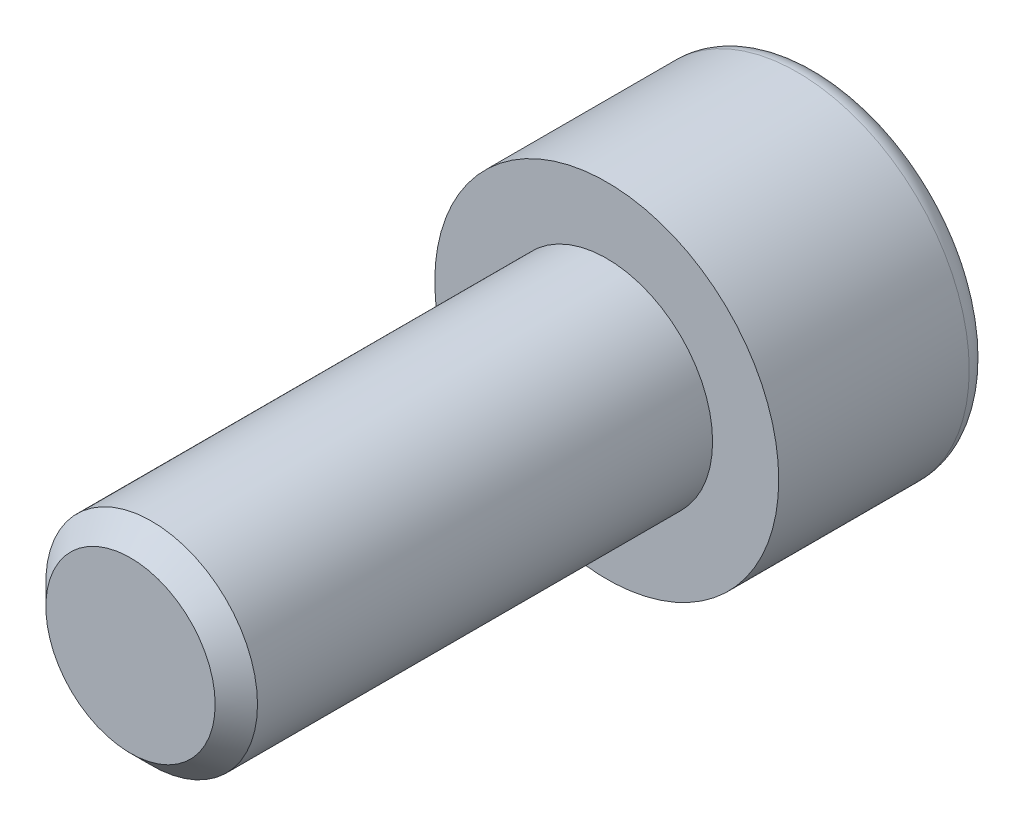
from build123d import *

# Parameters (mm, degrees)
ENLEV_MAT_EXTRU1_DEPTH = 4
ESQUISSE3_W            = 4
ESQUISSE3_H            = 18
CHANFREIN1_SIZE        = 0.8


with BuildPart() as part:
    # Esquisse1 → Base-R_volution (revolve)
    with BuildSketch(Plane(origin=(0, 0, 0), x_dir=(1, 0, 0), z_dir=(0, 1, 0)), mode=Mode.PRIVATE) as base_r_volution_sk:
        with BuildLine():
            Line((0, 0), (6.5, 0))
            Line((6.5, 0), (6.5, 7.2))
            ThreePointArc((6.5, 7.2), (6.265685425, 7.765685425), (5.7, 8))
            Line((5.7, 8), (0, 8))
            Line((0, 8), (0, 0))
        make_face()
    revolve(base_r_volution_sk.sketch.rotate(Axis((0, 0, 0), (0, 0, -1)), 180), axis=Axis((0, 0, 0), (0, 0, -1)))

    # Esquisse2 → enlev-mat-Extru1 (cut)
    with BuildSketch(Plane.XY.offset(-8)):
        Polygon((3, -1.732050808), (3, 1.732050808), (0, 3.464101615), (-3, 1.732050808), (-3, -1.732050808), (0, -3.464101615), align=None)
    extrude(amount=ENLEV_MAT_EXTRU1_DEPTH, mode=Mode.SUBTRACT)

    # Esquisse3 → Boss.-R_vol.1 (revolve)
    with BuildSketch(Plane(origin=(0, 0, 0), x_dir=(1, 0, 0), z_dir=(0, 1, 0))):
        with Locations((2, -9)):
            Rectangle(ESQUISSE3_W, ESQUISSE3_H)
    revolve(axis=Axis((0, 0, 0), (0, 0, 1)))

    # Chanfrein1
    chanfrein1_edges = [part.edges().sort_by_distance(p)[0] for p in [
        (-4, 0, 18),
    ]]
    chamfer(chanfrein1_edges, length=CHANFREIN1_SIZE)


solid = part.part
